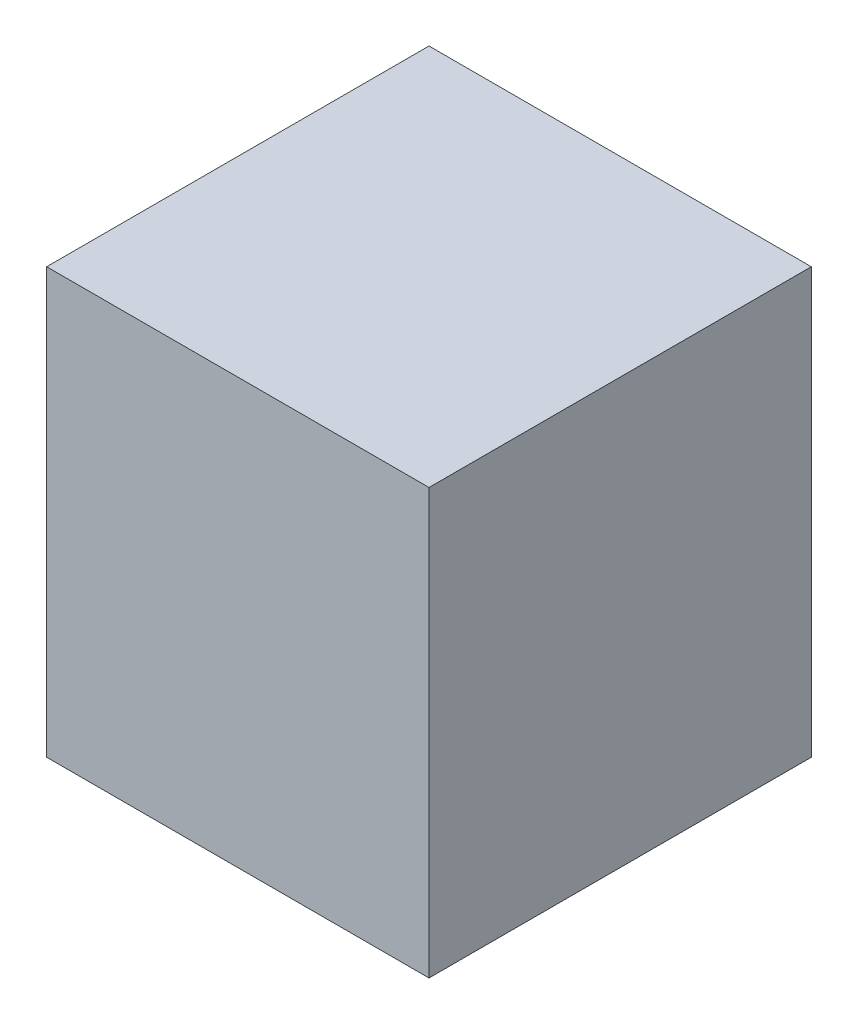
ISO-10303-21;
HEADER;
FILE_DESCRIPTION(('STEP AP214'),'2;1');
FILE_NAME('part.step','',(''),(''),'','','');
FILE_SCHEMA(('AUTOMOTIVE_DESIGN { 1 0 10303 214 1 1 1 1 }'));
ENDSEC;
DATA;
#1=APPLICATION_CONTEXT('core data for automotive mechanical design processes');
#2=APPLICATION_PROTOCOL_DEFINITION('international standard','automotive_design',2000,#1);
#3=PRODUCT_CONTEXT('',#1,'mechanical');
#4=PRODUCT('Part','Part','',(#3));
#5=PRODUCT_RELATED_PRODUCT_CATEGORY('part','',(#4));
#6=PRODUCT_DEFINITION_FORMATION('','',#4);
#7=PRODUCT_DEFINITION_CONTEXT('part definition',#1,'design');
#8=PRODUCT_DEFINITION('design','',#6,#7);
#9=PRODUCT_DEFINITION_SHAPE('','',#8);
#10=(LENGTH_UNIT() NAMED_UNIT(*) SI_UNIT(.MILLI.,.METRE.));
#11=(NAMED_UNIT(*) PLANE_ANGLE_UNIT() SI_UNIT($,.RADIAN.));
#12=(NAMED_UNIT(*) SI_UNIT($,.STERADIAN.) SOLID_ANGLE_UNIT());
#13=UNCERTAINTY_MEASURE_WITH_UNIT(LENGTH_MEASURE(1.E-05),#10,'distance_accuracy_value','');
#14=(GEOMETRIC_REPRESENTATION_CONTEXT(3) GLOBAL_UNCERTAINTY_ASSIGNED_CONTEXT((#13)) GLOBAL_UNIT_ASSIGNED_CONTEXT((#10,
#11,#12)) REPRESENTATION_CONTEXT('',''));
#15=CARTESIAN_POINT('',(0.,0.,0.));
#16=DIRECTION('',(0.,0.,1.));
#17=DIRECTION('',(1.,0.,0.));
#18=AXIS2_PLACEMENT_3D('',#15,#16,#17);
#19=CARTESIAN_POINT('',(0.,0.,0.4499991));
#20=DIRECTION('',(0.,0.,1.));
#21=DIRECTION('',(1.,0.,0.));
#22=AXIS2_PLACEMENT_3D('',#19,#20,#21);
#23=PLANE('',#22);
#24=DIRECTION('',(0.,1.,0.));
#25=VECTOR('',#24,1.);
#26=CARTESIAN_POINT('',(0.22500336,-0.2499995,0.4499991));
#27=LINE('',#26,#25);
#28=CARTESIAN_POINT('',(0.22500336,-0.2499995,0.4499991));
#29=VERTEX_POINT('',#28);
#30=CARTESIAN_POINT('',(0.22500336,0.2499995,0.4499991));
#31=VERTEX_POINT('',#30);
#32=EDGE_CURVE('E69',#29,#31,#27,.T.);
#33=ORIENTED_EDGE('',*,*,#32,.T.);
#34=DIRECTION('',(-1.,0.,0.));
#35=VECTOR('',#34,1.);
#36=CARTESIAN_POINT('',(0.22500336,0.2499995,0.4499991));
#37=LINE('',#36,#35);
#38=CARTESIAN_POINT('',(-0.22500336,0.2499995,0.4499991));
#39=VERTEX_POINT('',#38);
#40=EDGE_CURVE('E66',#31,#39,#37,.T.);
#41=ORIENTED_EDGE('',*,*,#40,.T.);
#42=DIRECTION('',(0.,-1.,0.));
#43=VECTOR('',#42,1.);
#44=CARTESIAN_POINT('',(-0.22500336,0.2499995,0.4499991));
#45=LINE('',#44,#43);
#46=CARTESIAN_POINT('',(-0.22500336,-0.2499995,0.4499991));
#47=VERTEX_POINT('',#46);
#48=EDGE_CURVE('E53',#39,#47,#45,.T.);
#49=ORIENTED_EDGE('',*,*,#48,.T.);
#50=DIRECTION('',(1.,0.,0.));
#51=VECTOR('',#50,1.);
#52=CARTESIAN_POINT('',(-0.22500336,-0.2499995,0.4499991));
#53=LINE('',#52,#51);
#54=EDGE_CURVE('E11',#47,#29,#53,.T.);
#55=ORIENTED_EDGE('',*,*,#54,.T.);
#56=EDGE_LOOP('',(#33,#41,#49,#55));
#57=FACE_BOUND('',#56,.T.);
#58=ADVANCED_FACE('F17',(#57),#23,.T.);
#59=CARTESIAN_POINT('',(0.,0.,0.));
#60=DIRECTION('',(0.,0.,1.));
#61=DIRECTION('',(1.,0.,0.));
#62=AXIS2_PLACEMENT_3D('',#59,#60,#61);
#63=PLANE('',#62);
#64=DIRECTION('',(1.,0.,0.));
#65=VECTOR('',#64,1.);
#66=CARTESIAN_POINT('',(-0.22500336,-0.2499995,0.));
#67=LINE('',#66,#65);
#68=CARTESIAN_POINT('',(-0.22500336,-0.2499995,0.));
#69=VERTEX_POINT('',#68);
#70=CARTESIAN_POINT('',(0.22500336,-0.2499995,0.));
#71=VERTEX_POINT('',#70);
#72=EDGE_CURVE('E26',#69,#71,#67,.T.);
#73=ORIENTED_EDGE('',*,*,#72,.F.);
#74=DIRECTION('',(0.,-1.,0.));
#75=VECTOR('',#74,1.);
#76=CARTESIAN_POINT('',(-0.22500336,0.2499995,0.));
#77=LINE('',#76,#75);
#78=CARTESIAN_POINT('',(-0.22500336,0.2499995,0.));
#79=VERTEX_POINT('',#78);
#80=EDGE_CURVE('E74',#79,#69,#77,.T.);
#81=ORIENTED_EDGE('',*,*,#80,.F.);
#82=DIRECTION('',(-1.,0.,0.));
#83=VECTOR('',#82,1.);
#84=CARTESIAN_POINT('',(0.22500336,0.2499995,0.));
#85=LINE('',#84,#83);
#86=CARTESIAN_POINT('',(0.22500336,0.2499995,0.));
#87=VERTEX_POINT('',#86);
#88=EDGE_CURVE('E77',#87,#79,#85,.T.);
#89=ORIENTED_EDGE('',*,*,#88,.F.);
#90=DIRECTION('',(0.,1.,0.));
#91=VECTOR('',#90,1.);
#92=CARTESIAN_POINT('',(0.22500336,-0.2499995,0.));
#93=LINE('',#92,#91);
#94=EDGE_CURVE('E88',#71,#87,#93,.T.);
#95=ORIENTED_EDGE('',*,*,#94,.F.);
#96=EDGE_LOOP('',(#73,#81,#89,#95));
#97=FACE_BOUND('',#96,.T.);
#98=ADVANCED_FACE('F156',(#97),#63,.F.);
#99=CARTESIAN_POINT('',(-0.22500336,-0.2499995,0.));
#100=DIRECTION('',(0.,1.,0.));
#101=DIRECTION('',(1.,0.,0.));
#102=AXIS2_PLACEMENT_3D('',#99,#100,#101);
#103=PLANE('',#102);
#104=ORIENTED_EDGE('',*,*,#72,.T.);
#105=DIRECTION('',(0.,0.,1.));
#106=VECTOR('',#105,1.);
#107=CARTESIAN_POINT('',(0.22500336,-0.2499995,0.));
#108=LINE('',#107,#106);
#109=EDGE_CURVE('E84',#71,#29,#108,.T.);
#110=ORIENTED_EDGE('',*,*,#109,.T.);
#111=ORIENTED_EDGE('',*,*,#54,.F.);
#112=DIRECTION('',(0.,0.,1.));
#113=VECTOR('',#112,1.);
#114=CARTESIAN_POINT('',(-0.22500336,-0.2499995,0.));
#115=LINE('',#114,#113);
#116=EDGE_CURVE('E60',#69,#47,#115,.T.);
#117=ORIENTED_EDGE('',*,*,#116,.F.);
#118=EDGE_LOOP('',(#104,#110,#111,#117));
#119=FACE_BOUND('',#118,.T.);
#120=ADVANCED_FACE('F147',(#119),#103,.F.);
#121=CARTESIAN_POINT('',(-0.22500336,0.2499995,0.));
#122=DIRECTION('',(1.,0.,0.));
#123=DIRECTION('',(0.,1.,0.));
#124=AXIS2_PLACEMENT_3D('',#121,#122,#123);
#125=PLANE('',#124);
#126=ORIENTED_EDGE('',*,*,#80,.T.);
#127=ORIENTED_EDGE('',*,*,#116,.T.);
#128=ORIENTED_EDGE('',*,*,#48,.F.);
#129=DIRECTION('',(0.,0.,1.));
#130=VECTOR('',#129,1.);
#131=CARTESIAN_POINT('',(-0.22500336,0.2499995,0.));
#132=LINE('',#131,#130);
#133=EDGE_CURVE('E58',#79,#39,#132,.T.);
#134=ORIENTED_EDGE('',*,*,#133,.F.);
#135=EDGE_LOOP('',(#126,#127,#128,#134));
#136=FACE_BOUND('',#135,.T.);
#137=ADVANCED_FACE('F56',(#136),#125,.F.);
#138=CARTESIAN_POINT('',(0.22500336,0.2499995,0.));
#139=DIRECTION('',(0.,-1.,0.));
#140=DIRECTION('',(0.,0.,-1.));
#141=AXIS2_PLACEMENT_3D('',#138,#139,#140);
#142=PLANE('',#141);
#143=ORIENTED_EDGE('',*,*,#88,.T.);
#144=ORIENTED_EDGE('',*,*,#133,.T.);
#145=ORIENTED_EDGE('',*,*,#40,.F.);
#146=DIRECTION('',(0.,0.,1.));
#147=VECTOR('',#146,1.);
#148=CARTESIAN_POINT('',(0.22500336,0.2499995,0.));
#149=LINE('',#148,#147);
#150=EDGE_CURVE('E90',#87,#31,#149,.T.);
#151=ORIENTED_EDGE('',*,*,#150,.F.);
#152=EDGE_LOOP('',(#143,#144,#145,#151));
#153=FACE_BOUND('',#152,.T.);
#154=ADVANCED_FACE('F75',(#153),#142,.F.);
#155=CARTESIAN_POINT('',(0.22500336,-0.2499995,0.));
#156=DIRECTION('',(-1.,0.,0.));
#157=DIRECTION('',(0.,0.,1.));
#158=AXIS2_PLACEMENT_3D('',#155,#156,#157);
#159=PLANE('',#158);
#160=ORIENTED_EDGE('',*,*,#94,.T.);
#161=ORIENTED_EDGE('',*,*,#150,.T.);
#162=ORIENTED_EDGE('',*,*,#32,.F.);
#163=ORIENTED_EDGE('',*,*,#109,.F.);
#164=EDGE_LOOP('',(#160,#161,#162,#163));
#165=FACE_BOUND('',#164,.T.);
#166=ADVANCED_FACE('F124',(#165),#159,.F.);
#167=CLOSED_SHELL('',(#58,#98,#120,#137,#154,#166));
#168=MANIFOLD_SOLID_BREP('B1',#167);
#169=ADVANCED_BREP_SHAPE_REPRESENTATION('',(#18,#168),#14);
#170=SHAPE_DEFINITION_REPRESENTATION(#9,#169);
ENDSEC;
END-ISO-10303-21;
